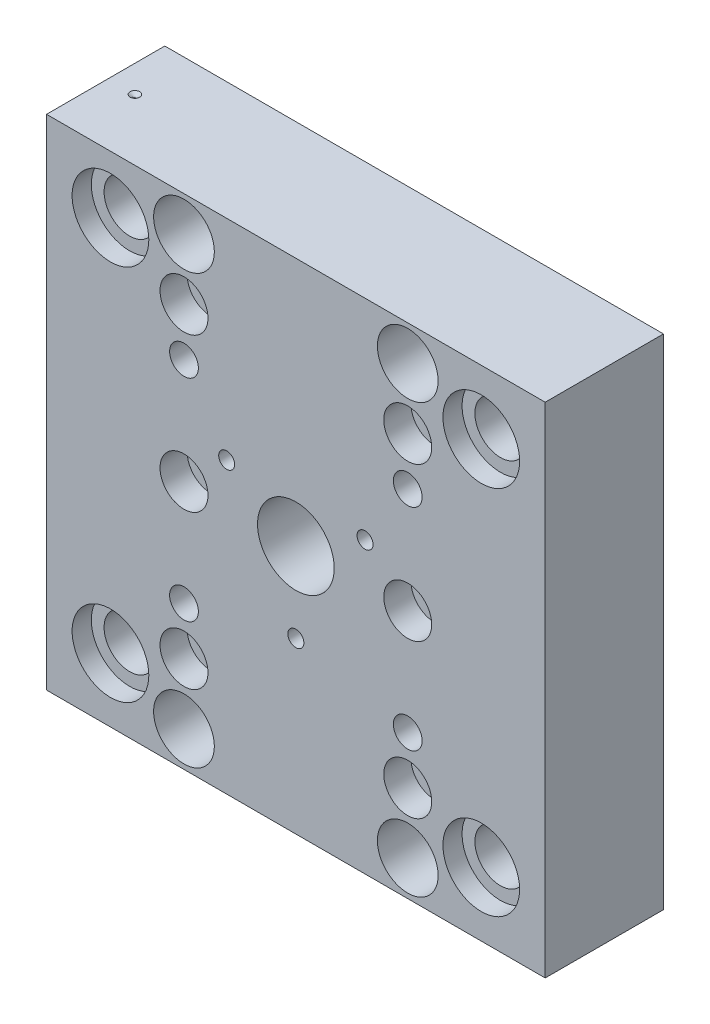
from build123d import *

# Parameters (mm, degrees)
ESQUISSE1_W                       = 156
ESQUISSE1_H                       = 156
ESQUISSE1_R                       = 9.5
EXTRUSION1_DEPTH                  = 37
ESQUISSE6_R                       = 7.5
ENL_V_MAT_EXTRU_1_DEPTH           = 8.5
ESQUISSE7_R                       = 7.5
ENL_V_MAT_EXTRU_2_DEPTH           = 8.5
ESQUISSE8_R                       = 7.5
ENL_V_MAT_EXTRU_3_DEPTH           = 8.5
ESQUISSE9_R                       = 7.5
ENL_V_MAT_EXTRU_4_DEPTH           = 8.5
ESQUISSE10_R                      = 7.5
ENL_V_MAT_EXTRU_5_DEPTH           = 8.5
ESQUISSE11_R                      = 7.5
ENL_V_MAT_EXTRU_6_DEPTH           = 8.5
ESQUISSE12_R                      = 4.5
ENL_V_MAT_EXTRU_7_DEPTH           = 37
ESQUISSE13_R                      = 4.5
ENL_V_MAT_EXTRU_8_DEPTH           = 37
ESQUISSE14_R                      = 4.5
ENL_V_MAT_EXTRU_9_DEPTH           = 37
ESQUISSE15_R                      = 4.5
ENL_V_MAT_EXTRU_10_DEPTH          = 37
ESQUISSE16_R                      = 4.5
ENL_V_MAT_EXTRU_11_DEPTH          = 37
ESQUISSE17_R                      = 4.5
ENL_V_MAT_EXTRU_12_DEPTH          = 37
ESQUISSE18_R                      = 4.5
ENL_V_MAT_EXTRU_13_DEPTH          = 14
ESQUISSE19_R                      = 4.5
ENL_V_MAT_EXTRU_14_DEPTH          = 14
ESQUISSE20_R                      = 4.5
ENL_V_MAT_EXTRU_15_DEPTH          = 14
ESQUISSE21_R                      = 4.5
ENL_V_MAT_EXTRU_16_DEPTH          = 14
ESQUISSE22_R                      = 4
ENL_V_MAT_EXTRU_17_DEPTH          = 37
ESQUISSE23_R                      = 4
ENL_V_MAT_EXTRU_18_DEPTH          = 37
ESQUISSE24_R                      = 4
ENL_V_MAT_EXTRU_19_DEPTH          = 37
ESQUISSE25_R                      = 4
ENL_V_MAT_EXTRU_20_DEPTH          = 37
ESQUISSE26_R                      = 12
ENL_V_MAT_EXTRU_21_DEPTH          = 6
ESQUISSE2_R                       = 8
ENL_V_MAT_EXTRU_22_DEPTH          = 37
ESQUISSE27_R                      = 12
ENL_V_MAT_EXTRU_23_DEPTH          = 6
ESQUISSE5_R                       = 8
ENL_V_MAT_EXTRU_24_DEPTH          = 37
ESQUISSE28_R                      = 12
ENL_V_MAT_EXTRU_25_DEPTH          = 6
ESQUISSE4_R                       = 8
ENL_V_MAT_EXTRU_26_DEPTH          = 37
ESQUISSE29_R                      = 12
ENL_V_MAT_EXTRU_27_DEPTH          = 6
ESQUISSE3_R                       = 8
ENL_V_MAT_EXTRU_28_DEPTH          = 37
ESQUISSE30_R                      = 12
ENL_V_MAT_EXTRU_29_DEPTH          = 37
TROU_TARAUD_M6X1_01_D             = 5
TROU_TARAUD_M6X1_01_DEPTH         = 15
TROU_TARAUD_M6X1_01_TIP           = 1.502151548
DIAM_TRE_DU_PER_AGE_3_0_3_1_D     = 3
DIAM_TRE_DU_PER_AGE_3_0_3_1_DEPTH = 0.001
DIAM_TRE_DU_PER_AGE_3_0_3_1_TIP   = 0.901290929


with BuildPart() as part:
    # Esquisse1 → Extrusion1 (new body)
    with BuildSketch(Plane.XY):
        Rectangle(ESQUISSE1_W, ESQUISSE1_H)
        with Locations((35, -67)):
            Circle(ESQUISSE1_R, mode=Mode.SUBTRACT)
        with Locations((35, 67)):
            Circle(ESQUISSE1_R, mode=Mode.SUBTRACT)
        with Locations((-35, 67)):
            Circle(ESQUISSE1_R, mode=Mode.SUBTRACT)
        with Locations((-35, -67)):
            Circle(ESQUISSE1_R, mode=Mode.SUBTRACT)
    extrude(amount=EXTRUSION1_DEPTH)

    # Esquisse6 → Enl_v. mat.-Extru.1 (cut)
    with BuildSketch(Plane.XY.offset(37)):
        with Locations((-35, 48)):
            Circle(ESQUISSE6_R)
    extrude(amount=-ENL_V_MAT_EXTRU_1_DEPTH, mode=Mode.SUBTRACT)

    # Esquisse7 → Enl_v. mat.-Extru.2 (cut)
    with BuildSketch(Plane.XY.offset(37)):
        with Locations((35, 48)):
            Circle(ESQUISSE7_R)
    extrude(amount=-ENL_V_MAT_EXTRU_2_DEPTH, mode=Mode.SUBTRACT)

    # Esquisse8 → Enl_v. mat.-Extru.3 (cut)
    with BuildSketch(Plane.XY.offset(37)):
        with Locations((-35, 0)):
            Circle(ESQUISSE8_R)
    extrude(amount=-ENL_V_MAT_EXTRU_3_DEPTH, mode=Mode.SUBTRACT)

    # Esquisse9 → Enl_v. mat.-Extru.4 (cut)
    with BuildSketch(Plane.XY.offset(37)):
        with Locations((35, 0)):
            Circle(ESQUISSE9_R)
    extrude(amount=-ENL_V_MAT_EXTRU_4_DEPTH, mode=Mode.SUBTRACT)

    # Esquisse10 → Enl_v. mat.-Extru.5 (cut)
    with BuildSketch(Plane.XY.offset(37)):
        with Locations((-35, -48)):
            Circle(ESQUISSE10_R)
    extrude(amount=-ENL_V_MAT_EXTRU_5_DEPTH, mode=Mode.SUBTRACT)

    # Esquisse11 → Enl_v. mat.-Extru.6 (cut)
    with BuildSketch(Plane.XY.offset(37)):
        with Locations((35, -48)):
            Circle(ESQUISSE11_R)
    extrude(amount=-ENL_V_MAT_EXTRU_6_DEPTH, mode=Mode.SUBTRACT)

    # Esquisse12 → Enl_v. mat.-Extru.7 (cut)
    with BuildSketch(Plane.XY.offset(37)):
        with Locations((35, -48)):
            Circle(ESQUISSE12_R)
    extrude(amount=-ENL_V_MAT_EXTRU_7_DEPTH, mode=Mode.SUBTRACT)

    # Esquisse13 → Enl_v. mat.-Extru.8 (cut)
    with BuildSketch(Plane.XY.offset(37)):
        with Locations((-35, -48)):
            Circle(ESQUISSE13_R)
    extrude(amount=-ENL_V_MAT_EXTRU_8_DEPTH, mode=Mode.SUBTRACT)

    # Esquisse14 → Enl_v. mat.-Extru.9 (cut)
    with BuildSketch(Plane.XY.offset(37)):
        with Locations((35, 0)):
            Circle(ESQUISSE14_R)
    extrude(amount=-ENL_V_MAT_EXTRU_9_DEPTH, mode=Mode.SUBTRACT)

    # Esquisse15 → Enl_v. mat.-Extru.10 (cut)
    with BuildSketch(Plane.XY.offset(37)):
        with Locations((-35, 0)):
            Circle(ESQUISSE15_R)
    extrude(amount=-ENL_V_MAT_EXTRU_10_DEPTH, mode=Mode.SUBTRACT)

    # Esquisse16 → Enl_v. mat.-Extru.11 (cut)
    with BuildSketch(Plane.XY.offset(37)):
        with Locations((-35, 48)):
            Circle(ESQUISSE16_R)
    extrude(amount=-ENL_V_MAT_EXTRU_11_DEPTH, mode=Mode.SUBTRACT)

    # Esquisse17 → Enl_v. mat.-Extru.12 (cut)
    with BuildSketch(Plane.XY.offset(37)):
        with Locations((35, 48)):
            Circle(ESQUISSE17_R)
    extrude(amount=-ENL_V_MAT_EXTRU_12_DEPTH, mode=Mode.SUBTRACT)

    # Esquisse18 → Enl_v. mat.-Extru.13 (cut)
    with BuildSketch(Plane.XY.offset(37)):
        with Locations((-35, 33)):
            Circle(ESQUISSE18_R)
    extrude(amount=-ENL_V_MAT_EXTRU_13_DEPTH, mode=Mode.SUBTRACT)

    # Esquisse19 → Enl_v. mat.-Extru.14 (cut)
    with BuildSketch(Plane.XY.offset(37)):
        with Locations((35, 33)):
            Circle(ESQUISSE19_R)
    extrude(amount=-ENL_V_MAT_EXTRU_14_DEPTH, mode=Mode.SUBTRACT)

    # Esquisse20 → Enl_v. mat.-Extru.15 (cut)
    with BuildSketch(Plane.XY.offset(37)):
        with Locations((35, -33)):
            Circle(ESQUISSE20_R)
    extrude(amount=-ENL_V_MAT_EXTRU_15_DEPTH, mode=Mode.SUBTRACT)

    # Esquisse21 → Enl_v. mat.-Extru.16 (cut)
    with BuildSketch(Plane.XY.offset(37)):
        with Locations((-35, -33)):
            Circle(ESQUISSE21_R)
    extrude(amount=-ENL_V_MAT_EXTRU_16_DEPTH, mode=Mode.SUBTRACT)

    # Esquisse22 → Enl_v. mat.-Extru.17 (cut)
    with BuildSketch(Plane.XY.offset(37)):
        with Locations((-35, -33)):
            Circle(ESQUISSE22_R)
    extrude(amount=-ENL_V_MAT_EXTRU_17_DEPTH, mode=Mode.SUBTRACT)

    # Esquisse23 → Enl_v. mat.-Extru.18 (cut)
    with BuildSketch(Plane.XY.offset(37)):
        with Locations((35, -33)):
            Circle(ESQUISSE23_R)
    extrude(amount=-ENL_V_MAT_EXTRU_18_DEPTH, mode=Mode.SUBTRACT)

    # Esquisse24 → Enl_v. mat.-Extru.19 (cut)
    with BuildSketch(Plane.XY.offset(37)):
        with Locations((35, 33)):
            Circle(ESQUISSE24_R)
    extrude(amount=-ENL_V_MAT_EXTRU_19_DEPTH, mode=Mode.SUBTRACT)

    # Esquisse25 → Enl_v. mat.-Extru.20 (cut)
    with BuildSketch(Plane.XY.offset(37)):
        with Locations((-35, 33)):
            Circle(ESQUISSE25_R)
    extrude(amount=-ENL_V_MAT_EXTRU_20_DEPTH, mode=Mode.SUBTRACT)

    # Esquisse26 → Enl_v. mat.-Extru.21 (cut)
    with BuildSketch(Plane.XY.offset(37)):
        with Locations((-58, 60)):
            Circle(ESQUISSE26_R)
    extrude(amount=-ENL_V_MAT_EXTRU_21_DEPTH, mode=Mode.SUBTRACT)

    # Esquisse2 → Enl_v. mat.-Extru.22 (cut)
    with BuildSketch(Plane.XY.offset(37)):
        with Locations((-58, 60)):
            Circle(ESQUISSE2_R)
    extrude(amount=-ENL_V_MAT_EXTRU_22_DEPTH, mode=Mode.SUBTRACT)

    # Esquisse27 → Enl_v. mat.-Extru.23 (cut)
    with BuildSketch(Plane.XY.offset(37)):
        with Locations((-58, -58)):
            Circle(ESQUISSE27_R)
    extrude(amount=-ENL_V_MAT_EXTRU_23_DEPTH, mode=Mode.SUBTRACT)

    # Esquisse5 → Enl_v. mat.-Extru.24 (cut)
    with BuildSketch(Plane.XY.offset(37)):
        with Locations((-58, -58)):
            Circle(ESQUISSE5_R)
    extrude(amount=-ENL_V_MAT_EXTRU_24_DEPTH, mode=Mode.SUBTRACT)

    # Esquisse28 → Enl_v. mat.-Extru.25 (cut)
    with BuildSketch(Plane.XY.offset(37)):
        with Locations((58, -58)):
            Circle(ESQUISSE28_R)
    extrude(amount=-ENL_V_MAT_EXTRU_25_DEPTH, mode=Mode.SUBTRACT)

    # Esquisse4 → Enl_v. mat.-Extru.26 (cut)
    with BuildSketch(Plane.XY.offset(37)):
        with Locations((58, -58)):
            Circle(ESQUISSE4_R)
    extrude(amount=-ENL_V_MAT_EXTRU_26_DEPTH, mode=Mode.SUBTRACT)

    # Esquisse29 → Enl_v. mat.-Extru.27 (cut)
    with BuildSketch(Plane.XY.offset(37)):
        with Locations((58, 58)):
            Circle(ESQUISSE29_R)
    extrude(amount=-ENL_V_MAT_EXTRU_27_DEPTH, mode=Mode.SUBTRACT)

    # Esquisse3 → Enl_v. mat.-Extru.28 (cut)
    with BuildSketch(Plane.XY.offset(37)):
        with Locations((58, 58)):
            Circle(ESQUISSE3_R)
    extrude(amount=-ENL_V_MAT_EXTRU_28_DEPTH, mode=Mode.SUBTRACT)

    # Esquisse30 → Enl_v. mat.-Extru.29 (cut)
    with BuildSketch(Plane.XY):
        Circle(ESQUISSE30_R)
    extrude(amount=ENL_V_MAT_EXTRU_29_DEPTH, mode=Mode.SUBTRACT)

    # Trou taraud_ M6x1.01
    with Locations(Plane.XY.offset(37)):
        with Locations((21.650635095, 12.5), (0, -25), (-21.650635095, 12.5)):
            Hole(TROU_TARAUD_M6X1_01_D / 2, depth=TROU_TARAUD_M6X1_01_DEPTH)
            with Locations((0, 0, -(TROU_TARAUD_M6X1_01_DEPTH + TROU_TARAUD_M6X1_01_TIP / 2))):  # 118° drill point
                Cone(0, TROU_TARAUD_M6X1_01_D / 2, TROU_TARAUD_M6X1_01_TIP, mode=Mode.SUBTRACT)

    # Diam_tre du per_age _3.0 _3_1
    with Locations(Plane(origin=(0, 78, 0), x_dir=(-1, 0, 0), z_dir=(0, 1, 0))):
        with Locations((69.556276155, 17.797946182)):
            Hole(DIAM_TRE_DU_PER_AGE_3_0_3_1_D / 2, depth=DIAM_TRE_DU_PER_AGE_3_0_3_1_DEPTH)
            with Locations((0, 0, -(DIAM_TRE_DU_PER_AGE_3_0_3_1_DEPTH + DIAM_TRE_DU_PER_AGE_3_0_3_1_TIP / 2))):  # 118° drill point
                Cone(0, DIAM_TRE_DU_PER_AGE_3_0_3_1_D / 2, DIAM_TRE_DU_PER_AGE_3_0_3_1_TIP, mode=Mode.SUBTRACT)


solid = part.part
